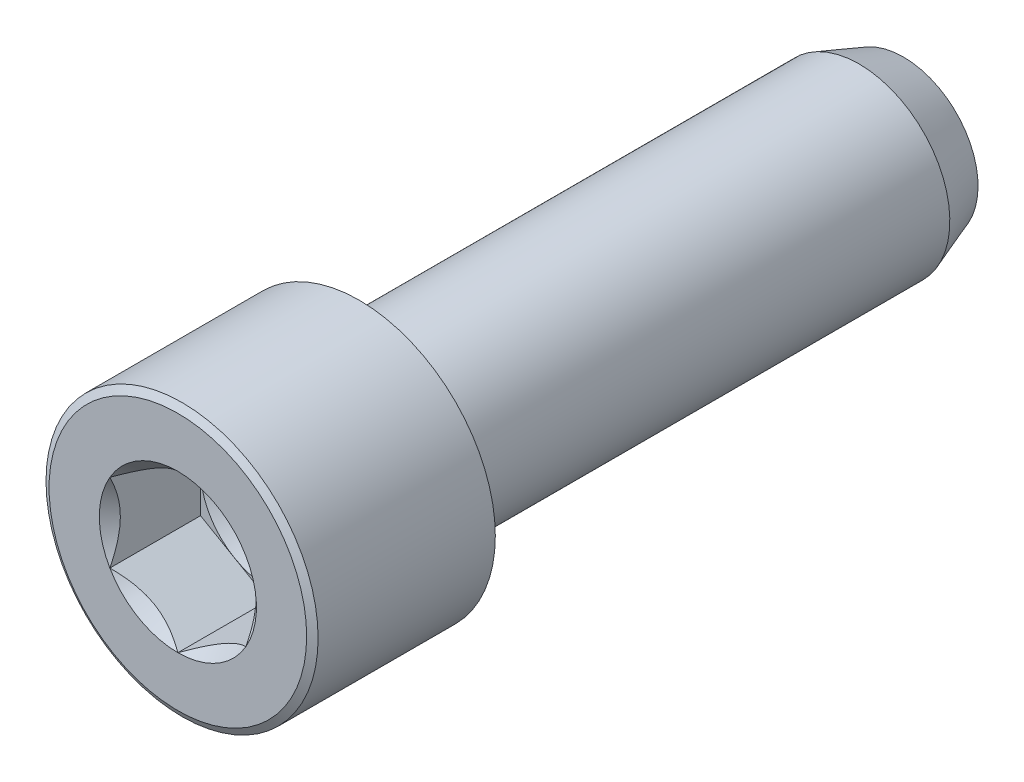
from build123d import *

# Parameters (mm, degrees)
SKETCH1_W          = 19.05
SKETCH1_H          = 3.175
SKETCH4_R          = 4.7625
EXTRUDE1_DEPTH     = 6.35
CHAMFER1_SIZE      = 0.254
CHAMFER1_SIZE2     = 0.146646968
CUT_EXTRUDE1_DEPTH = 3.175
SKETCH8_R          = 2.38125
CUT_EXTRUDE5_DEPTH = 1.058333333
CUT_EXTRUDE5_DRAFT = -60


with BuildPart() as part:
    # Sketch1 → Revolve1 (revolve)
    with BuildSketch(Plane(origin=(0, 0, 0), x_dir=(0, 0, -1), z_dir=(1, 0, 0))):
        with Locations((9.525, 1.5875)):
            Rectangle(SKETCH1_W, SKETCH1_H)
    revolve(axis=Axis((0, 0, 0), (0, 0, 1)))

    # Sketch3 → Cut-Revolve2 (revolve, cut)
    with BuildSketch(Plane(origin=(0, 0, 0), x_dir=(0, 0, -1), z_dir=(1, 0, 0))):
        Polygon((19.05, 2.609908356), (17.497423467, 3.175), (19.05, 3.175), align=None)
    revolve(axis=Axis((0, 0, -17.497423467), (0, 0, 1)), mode=Mode.SUBTRACT)

    # Sketch4 → Extrude1 (add)
    with BuildSketch(Plane.XY):
        Circle(SKETCH4_R)
    extrude(amount=EXTRUDE1_DEPTH)

    # Chamfer1
    chamfer1_edges = [part.edges().sort_by_distance(p)[0] for p in [
        (-4.7625, 0, 6.35),
    ]]
    chamfer1_side = [part.faces().sort_by_distance(p)[0] for p in [
        (0, 0, 6.35),
    ]]
    chamfer(chamfer1_edges, length=CHAMFER1_SIZE, length2=CHAMFER1_SIZE2, reference=chamfer1_side[0])

    # Sketch6 → Cut-Extrude1 (cut)
    with BuildSketch(Plane.XY.offset(6.35)):
        Polygon((0, -2.749630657), (2.38125, -1.374815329), (2.38125, 1.374815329), (0, 2.749630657), (-2.38125, 1.374815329), (-2.38125, -1.374815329), align=None)
    extrude(amount=-CUT_EXTRUDE1_DEPTH, mode=Mode.SUBTRACT)

    # Cut-Extrude4 cone 1 section (on through the dimple's axis) → Cut-Extrude4 (revolve, cut)
    with BuildSketch(Plane(origin=(0, 0, 6.35), x_dir=(0, -1, 0), z_dir=(1, 0, 0))):
        Polygon((0, 0), (2.749630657, 0), (0, 2.749630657), align=None)
    revolve(axis=Axis((0, 0, 6.35), (0, 0, -1)), mode=Mode.SUBTRACT)


with BuildPart() as cut_extrude5_tool:
    # Sketch8 → Cut-Extrude5 (with draft: the straight prism first)
    with BuildSketch(Plane.XY.offset(3.175)):
        Circle(SKETCH8_R)
    extrude(amount=-CUT_EXTRUDE5_DEPTH)
    # Cut-Extrude5: the draft: its side faces are tilted about the plane it starts from
    cut_extrude5_sides = [cut_extrude5_tool.faces().sort_by_distance(p)[0] for p in [
        (-2.38125, 0, 2.645833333),
    ]]
    draft(cut_extrude5_sides, Plane.XY.offset(3.175), CUT_EXTRUDE5_DRAFT)


with BuildPart() as part_1:
    add(part.part)

    # Cut-Extrude5: cut by cut_extrude5_tool
    add(cut_extrude5_tool.part, mode=Mode.SUBTRACT)


solid = part_1.part
